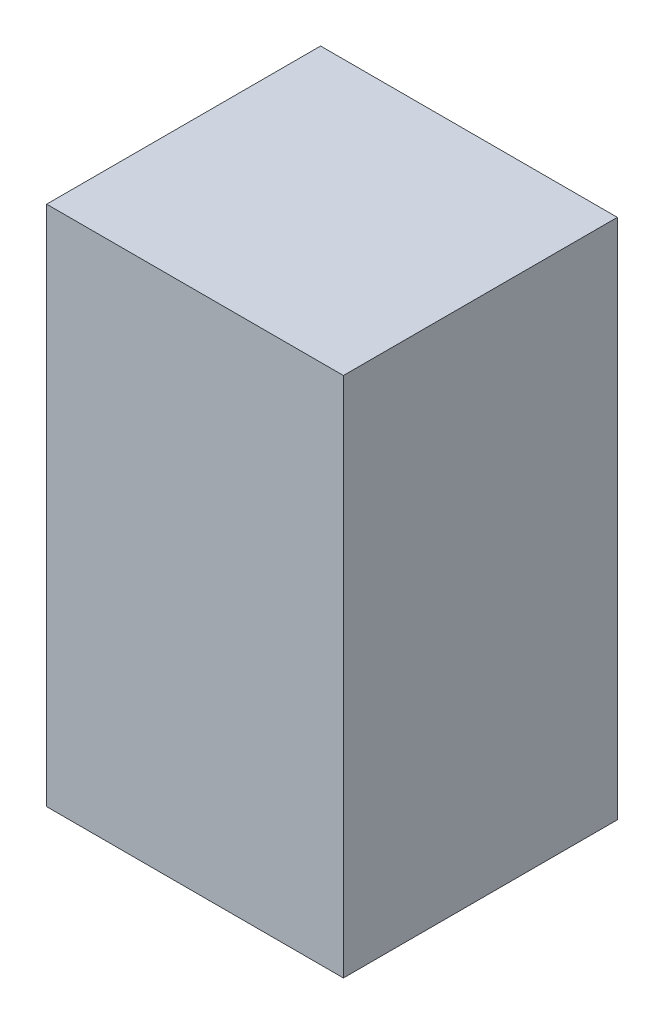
ISO-10303-21;
HEADER;
FILE_DESCRIPTION(('STEP AP214'),'2;1');
FILE_NAME('part.step','',(''),(''),'','','');
FILE_SCHEMA(('AUTOMOTIVE_DESIGN { 1 0 10303 214 1 1 1 1 }'));
ENDSEC;
DATA;
#1=APPLICATION_CONTEXT('core data for automotive mechanical design processes');
#2=APPLICATION_PROTOCOL_DEFINITION('international standard','automotive_design',2000,#1);
#3=PRODUCT_CONTEXT('',#1,'mechanical');
#4=PRODUCT('Part','Part','',(#3));
#5=PRODUCT_RELATED_PRODUCT_CATEGORY('part','',(#4));
#6=PRODUCT_DEFINITION_FORMATION('','',#4);
#7=PRODUCT_DEFINITION_CONTEXT('part definition',#1,'design');
#8=PRODUCT_DEFINITION('design','',#6,#7);
#9=PRODUCT_DEFINITION_SHAPE('','',#8);
#10=(LENGTH_UNIT() NAMED_UNIT(*) SI_UNIT(.MILLI.,.METRE.));
#11=(NAMED_UNIT(*) PLANE_ANGLE_UNIT() SI_UNIT($,.RADIAN.));
#12=(NAMED_UNIT(*) SI_UNIT($,.STERADIAN.) SOLID_ANGLE_UNIT());
#13=UNCERTAINTY_MEASURE_WITH_UNIT(LENGTH_MEASURE(1.E-05),#10,'distance_accuracy_value','');
#14=(GEOMETRIC_REPRESENTATION_CONTEXT(3) GLOBAL_UNCERTAINTY_ASSIGNED_CONTEXT((#13)) GLOBAL_UNIT_ASSIGNED_CONTEXT((#10,
#11,#12)) REPRESENTATION_CONTEXT('',''));
#15=CARTESIAN_POINT('',(0.,0.,0.));
#16=DIRECTION('',(0.,0.,1.));
#17=DIRECTION('',(1.,0.,0.));
#18=AXIS2_PLACEMENT_3D('',#15,#16,#17);
#19=CARTESIAN_POINT('',(-9.52499999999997,40.64,-10.668));
#20=DIRECTION('',(1.,0.,0.));
#21=DIRECTION('',(0.,0.,-1.));
#22=AXIS2_PLACEMENT_3D('',#19,#20,#21);
#23=PLANE('',#22);
#24=DIRECTION('',(0.,0.,1.));
#25=VECTOR('',#24,1.);
#26=CARTESIAN_POINT('',(-9.525,0.,-10.668));
#27=LINE('',#26,#25);
#28=CARTESIAN_POINT('',(-9.525,0.,-10.668));
#29=VERTEX_POINT('',#28);
#30=CARTESIAN_POINT('',(-9.52500000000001,0.,10.668));
#31=VERTEX_POINT('',#30);
#32=EDGE_CURVE('E82',#29,#31,#27,.T.);
#33=ORIENTED_EDGE('',*,*,#32,.T.);
#34=DIRECTION('',(0.,-1.,0.));
#35=VECTOR('',#34,1.);
#36=CARTESIAN_POINT('',(-9.52500000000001,40.64,10.668));
#37=LINE('',#36,#35);
#38=CARTESIAN_POINT('',(-9.52500000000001,40.64,10.668));
#39=VERTEX_POINT('',#38);
#40=EDGE_CURVE('E11',#39,#31,#37,.T.);
#41=ORIENTED_EDGE('',*,*,#40,.F.);
#42=DIRECTION('',(0.,0.,1.));
#43=VECTOR('',#42,1.);
#44=CARTESIAN_POINT('',(-9.52499999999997,40.64,-10.668));
#45=LINE('',#44,#43);
#46=CARTESIAN_POINT('',(-9.52499999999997,40.64,-10.668));
#47=VERTEX_POINT('',#46);
#48=EDGE_CURVE('E100',#47,#39,#45,.T.);
#49=ORIENTED_EDGE('',*,*,#48,.F.);
#50=DIRECTION('',(0.,-1.,0.));
#51=VECTOR('',#50,1.);
#52=CARTESIAN_POINT('',(-9.52499999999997,40.64,-10.668));
#53=LINE('',#52,#51);
#54=EDGE_CURVE('E94',#47,#29,#53,.T.);
#55=ORIENTED_EDGE('',*,*,#54,.T.);
#56=EDGE_LOOP('',(#33,#41,#49,#55));
#57=FACE_BOUND('',#56,.T.);
#58=ADVANCED_FACE('F38',(#57),#23,.F.);
#59=CARTESIAN_POINT('',(-9.52500000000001,40.64,10.668));
#60=DIRECTION('',(0.,0.,-1.));
#61=DIRECTION('',(-1.,0.,0.));
#62=AXIS2_PLACEMENT_3D('',#59,#60,#61);
#63=PLANE('',#62);
#64=DIRECTION('',(1.,0.,0.));
#65=VECTOR('',#64,1.);
#66=CARTESIAN_POINT('',(-9.52500000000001,0.,10.668));
#67=LINE('',#66,#65);
#68=CARTESIAN_POINT('',(13.589,0.,10.668));
#69=VERTEX_POINT('',#68);
#70=EDGE_CURVE('E78',#31,#69,#67,.T.);
#71=ORIENTED_EDGE('',*,*,#70,.T.);
#72=DIRECTION('',(0.,-1.,0.));
#73=VECTOR('',#72,1.);
#74=CARTESIAN_POINT('',(13.589,40.6400000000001,10.668));
#75=LINE('',#74,#73);
#76=CARTESIAN_POINT('',(13.589,40.6400000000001,10.668));
#77=VERTEX_POINT('',#76);
#78=EDGE_CURVE('E45',#77,#69,#75,.T.);
#79=ORIENTED_EDGE('',*,*,#78,.F.);
#80=DIRECTION('',(1.,0.,0.));
#81=VECTOR('',#80,1.);
#82=CARTESIAN_POINT('',(-9.52500000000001,40.64,10.668));
#83=LINE('',#82,#81);
#84=EDGE_CURVE('E90',#39,#77,#83,.T.);
#85=ORIENTED_EDGE('',*,*,#84,.F.);
#86=ORIENTED_EDGE('',*,*,#40,.T.);
#87=EDGE_LOOP('',(#71,#79,#85,#86));
#88=FACE_BOUND('',#87,.T.);
#89=ADVANCED_FACE('F89',(#88),#63,.F.);
#90=CARTESIAN_POINT('',(13.589,40.64,-10.668));
#91=DIRECTION('',(-1.,0.,0.));
#92=DIRECTION('',(0.,0.,1.));
#93=AXIS2_PLACEMENT_3D('',#90,#91,#92);
#94=PLANE('',#93);
#95=DIRECTION('',(0.,0.,-1.));
#96=VECTOR('',#95,1.);
#97=CARTESIAN_POINT('',(13.589,0.,-10.668));
#98=LINE('',#97,#96);
#99=CARTESIAN_POINT('',(13.589,0.,-10.668));
#100=VERTEX_POINT('',#99);
#101=EDGE_CURVE('E83',#69,#100,#98,.T.);
#102=ORIENTED_EDGE('',*,*,#101,.T.);
#103=DIRECTION('',(0.,-1.,0.));
#104=VECTOR('',#103,1.);
#105=CARTESIAN_POINT('',(13.589,40.64,-10.668));
#106=LINE('',#105,#104);
#107=CARTESIAN_POINT('',(13.589,40.64,-10.668));
#108=VERTEX_POINT('',#107);
#109=EDGE_CURVE('E106',#108,#100,#106,.T.);
#110=ORIENTED_EDGE('',*,*,#109,.F.);
#111=DIRECTION('',(0.,0.,-1.));
#112=VECTOR('',#111,1.);
#113=CARTESIAN_POINT('',(13.589,40.64,-10.668));
#114=LINE('',#113,#112);
#115=EDGE_CURVE('E57',#77,#108,#114,.T.);
#116=ORIENTED_EDGE('',*,*,#115,.F.);
#117=ORIENTED_EDGE('',*,*,#78,.T.);
#118=EDGE_LOOP('',(#102,#110,#116,#117));
#119=FACE_BOUND('',#118,.T.);
#120=ADVANCED_FACE('F109',(#119),#94,.F.);
#121=CARTESIAN_POINT('',(-9.52499999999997,40.64,-10.668));
#122=DIRECTION('',(0.,0.,1.));
#123=DIRECTION('',(1.,0.,0.));
#124=AXIS2_PLACEMENT_3D('',#121,#122,#123);
#125=PLANE('',#124);
#126=DIRECTION('',(-1.,0.,0.));
#127=VECTOR('',#126,1.);
#128=CARTESIAN_POINT('',(-9.525,0.,-10.668));
#129=LINE('',#128,#127);
#130=EDGE_CURVE('E98',#100,#29,#129,.T.);
#131=ORIENTED_EDGE('',*,*,#130,.T.);
#132=ORIENTED_EDGE('',*,*,#54,.F.);
#133=DIRECTION('',(-1.,0.,0.));
#134=VECTOR('',#133,1.);
#135=CARTESIAN_POINT('',(-9.52499999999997,40.64,-10.668));
#136=LINE('',#135,#134);
#137=EDGE_CURVE('E52',#108,#47,#136,.T.);
#138=ORIENTED_EDGE('',*,*,#137,.F.);
#139=ORIENTED_EDGE('',*,*,#109,.T.);
#140=EDGE_LOOP('',(#131,#132,#138,#139));
#141=FACE_BOUND('',#140,.T.);
#142=ADVANCED_FACE('F111',(#141),#125,.F.);
#143=CARTESIAN_POINT('',(-9.52499999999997,40.64,-10.668));
#144=DIRECTION('',(0.,1.,0.));
#145=DIRECTION('',(0.,0.,1.));
#146=AXIS2_PLACEMENT_3D('',#143,#144,#145);
#147=PLANE('',#146);
#148=ORIENTED_EDGE('',*,*,#48,.T.);
#149=ORIENTED_EDGE('',*,*,#84,.T.);
#150=ORIENTED_EDGE('',*,*,#115,.T.);
#151=ORIENTED_EDGE('',*,*,#137,.T.);
#152=EDGE_LOOP('',(#148,#149,#150,#151));
#153=FACE_BOUND('',#152,.T.);
#154=ADVANCED_FACE('F112',(#153),#147,.T.);
#155=CARTESIAN_POINT('',(-9.525,0.,-10.668));
#156=DIRECTION('',(0.,1.,0.));
#157=DIRECTION('',(0.,0.,1.));
#158=AXIS2_PLACEMENT_3D('',#155,#156,#157);
#159=PLANE('',#158);
#160=ORIENTED_EDGE('',*,*,#32,.F.);
#161=ORIENTED_EDGE('',*,*,#130,.F.);
#162=ORIENTED_EDGE('',*,*,#101,.F.);
#163=ORIENTED_EDGE('',*,*,#70,.F.);
#164=EDGE_LOOP('',(#160,#161,#162,#163));
#165=FACE_BOUND('',#164,.T.);
#166=ADVANCED_FACE('F79',(#165),#159,.F.);
#167=CLOSED_SHELL('',(#58,#89,#120,#142,#154,#166));
#168=MANIFOLD_SOLID_BREP('B2',#167);
#169=ADVANCED_BREP_SHAPE_REPRESENTATION('',(#18,#168),#14);
#170=SHAPE_DEFINITION_REPRESENTATION(#9,#169);
ENDSEC;
END-ISO-10303-21;
